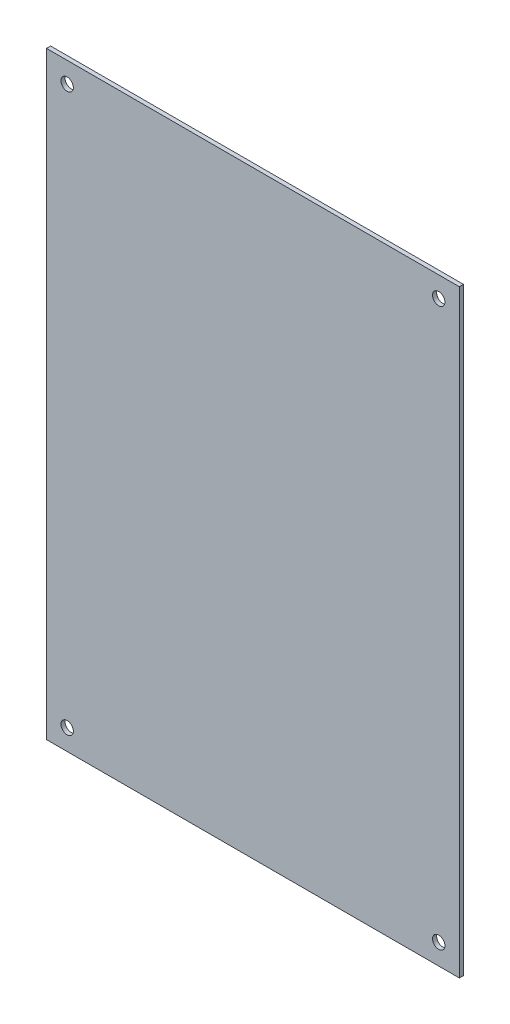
from build123d import *

# Parameters (mm, degrees)
ESQUISSE1_W                           = 100
ESQUISSE1_H                           = 145
EXTRUSION1_DEPTH                      = 1
DIAM_TRE_DU_PER_AGE_M3_0_3_000000_1_D = 3


with BuildPart() as part:
    # Esquisse1 → Extrusion1 (new body)
    with BuildSketch(Plane.XY):
        with Locations((0, -72.5)):
            Rectangle(ESQUISSE1_W, ESQUISSE1_H)
    extrude(amount=EXTRUSION1_DEPTH)

    # Diam_tre du per_age M3.0 _3.000000_1 (through all)
    with Locations(Plane.XY.offset(1)):
        with Locations((-45, -5), (45, -5), (-45, -140), (45, -140)):
            Hole(DIAM_TRE_DU_PER_AGE_M3_0_3_000000_1_D / 2)


solid = part.part
